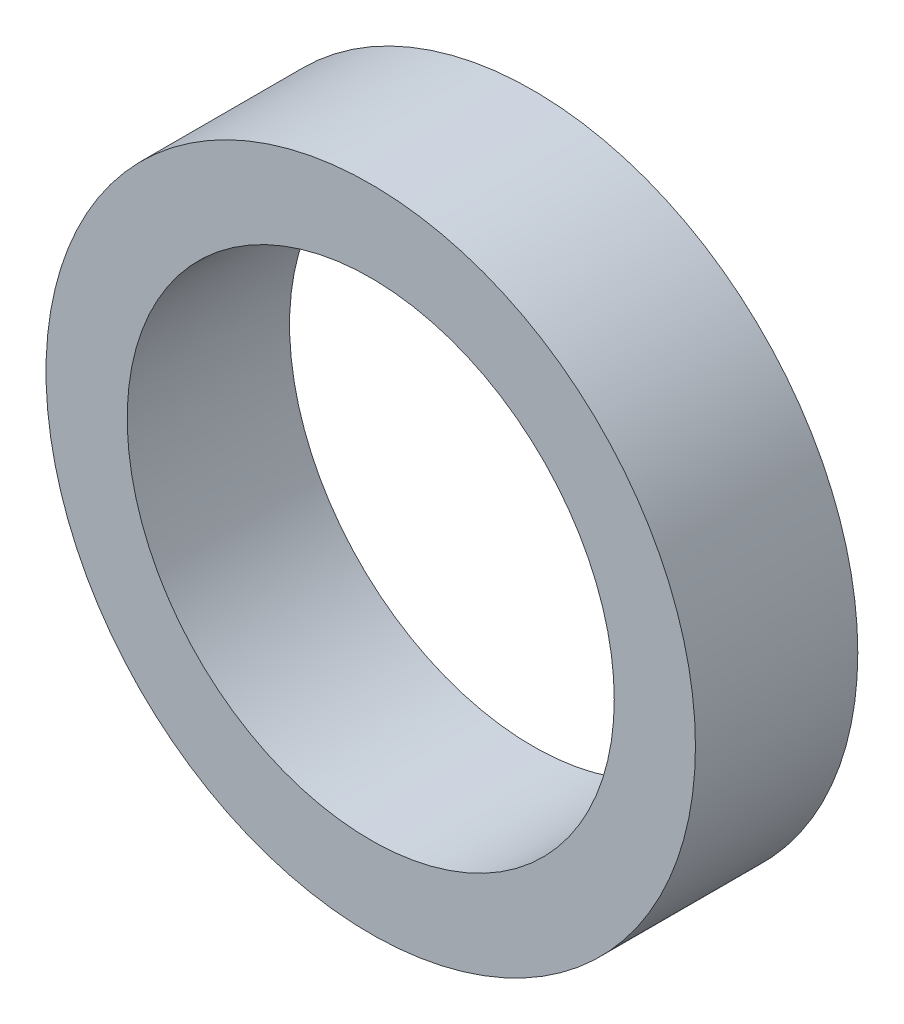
from build123d import *

# Parameters (mm, degrees)
SKETCH_1_R      = 12
SKETCH_1_R_2    = 9
EXTRUDE_1_DEPTH = 6


with BuildPart() as part:
    # Sketch 1 → Extrude 1 (new body)
    with BuildSketch(Plane.XY):
        Circle(SKETCH_1_R)
        Circle(SKETCH_1_R_2, mode=Mode.SUBTRACT)
    extrude(amount=EXTRUDE_1_DEPTH)


solid = part.part
